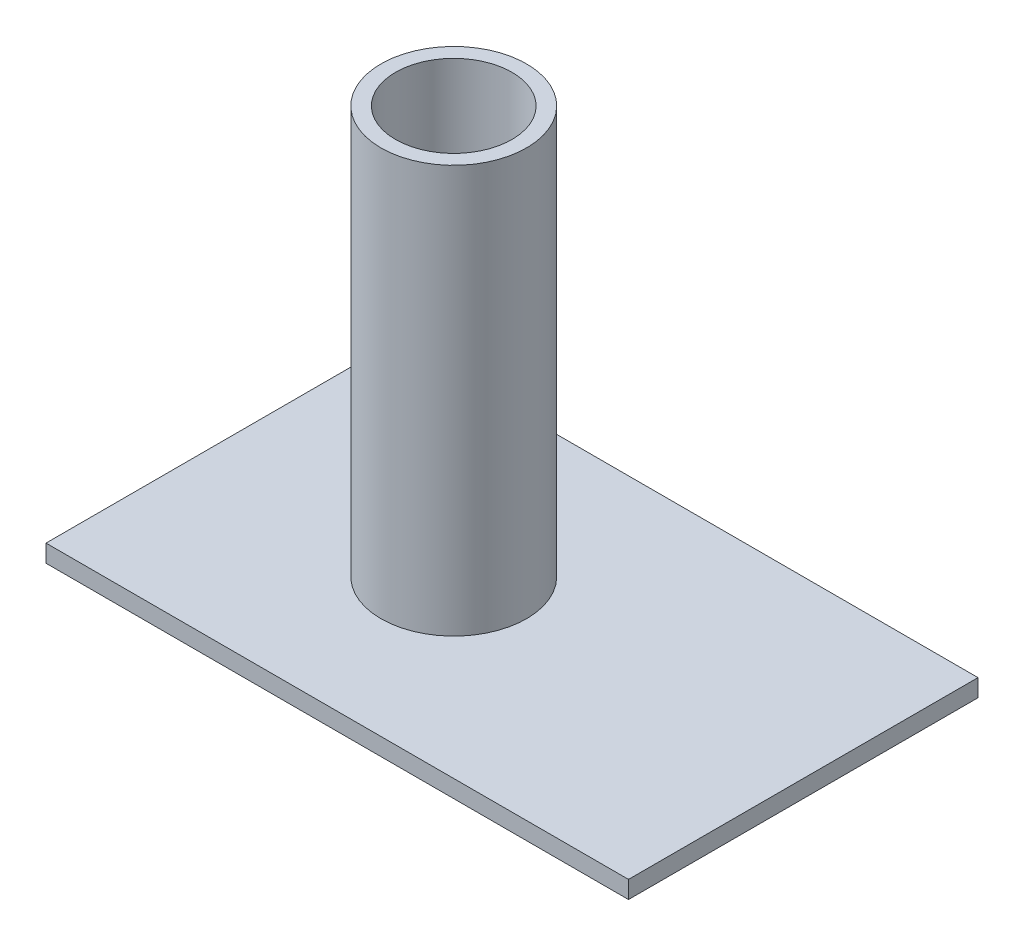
from build123d import *

# Parameters (mm, degrees)
SKETCH1_W           = 100
SKETCH1_H           = 60
BOSS_EXTRUDE1_DEPTH = 3
SKETCH2_R           = 12.5
SKETCH2_R_2         = 10
BOSS_EXTRUDE2_DEPTH = 70


with BuildPart() as part:
    # Sketch1 → Boss-Extrude1 (new body)
    with BuildSketch(Plane(origin=(0, 0, 0), x_dir=(1, 0, 0), z_dir=(0, 1, 0))):
        Rectangle(SKETCH1_W, SKETCH1_H)
    extrude(amount=-BOSS_EXTRUDE1_DEPTH)

    # Sketch2 → Boss-Extrude2 (add)
    with BuildSketch(Plane(origin=(0, 0, 0), x_dir=(1, 0, 0), z_dir=(0, 1, 0))):
        with Locations(Location((-10, 0, 0), (0, 0, 270))):
            Circle(SKETCH2_R)
        with Locations(Location((-10, 0, 0), (0, 0, 270))):
            Circle(SKETCH2_R_2, mode=Mode.SUBTRACT)
    extrude(amount=BOSS_EXTRUDE2_DEPTH)


solid = part.part
